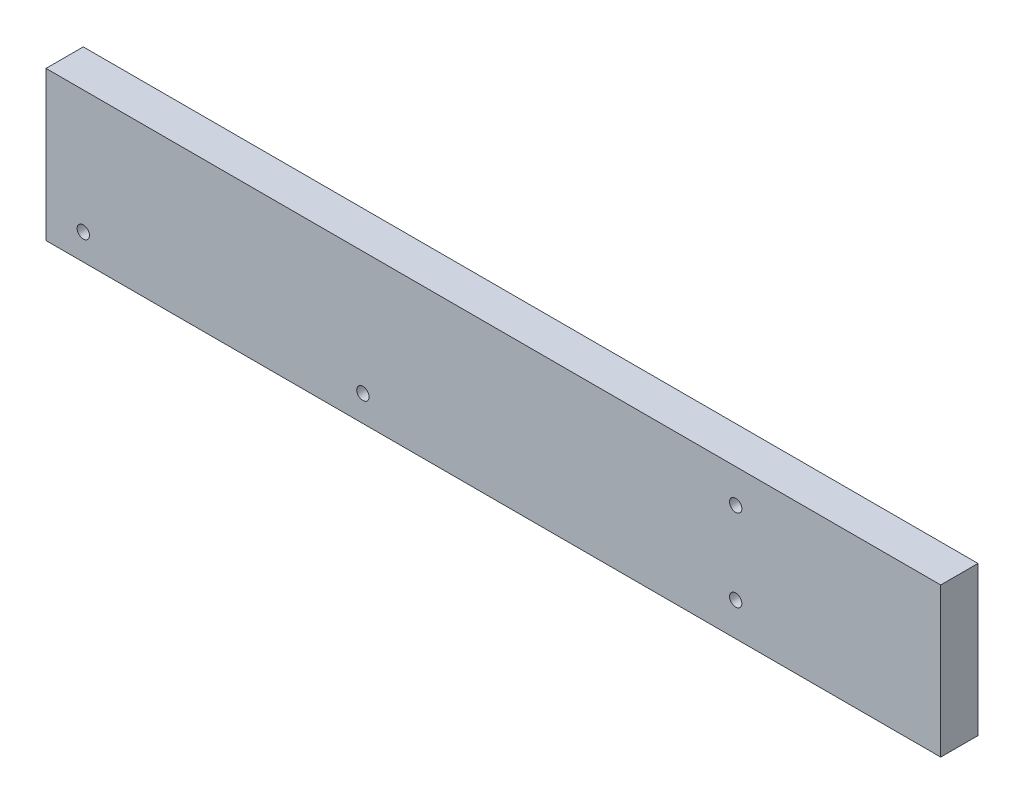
ISO-10303-21;
HEADER;
FILE_DESCRIPTION(('STEP AP214'),'2;1');
FILE_NAME('part.step','',(''),(''),'','','');
FILE_SCHEMA(('AUTOMOTIVE_DESIGN { 1 0 10303 214 1 1 1 1 }'));
ENDSEC;
DATA;
#1=APPLICATION_CONTEXT('core data for automotive mechanical design processes');
#2=APPLICATION_PROTOCOL_DEFINITION('international standard','automotive_design',2000,#1);
#3=PRODUCT_CONTEXT('',#1,'mechanical');
#4=PRODUCT('Part','Part','',(#3));
#5=PRODUCT_RELATED_PRODUCT_CATEGORY('part','',(#4));
#6=PRODUCT_DEFINITION_FORMATION('','',#4);
#7=PRODUCT_DEFINITION_CONTEXT('part definition',#1,'design');
#8=PRODUCT_DEFINITION('design','',#6,#7);
#9=PRODUCT_DEFINITION_SHAPE('','',#8);
#10=(LENGTH_UNIT() NAMED_UNIT(*) SI_UNIT(.MILLI.,.METRE.));
#11=(NAMED_UNIT(*) PLANE_ANGLE_UNIT() SI_UNIT($,.RADIAN.));
#12=(NAMED_UNIT(*) SI_UNIT($,.STERADIAN.) SOLID_ANGLE_UNIT());
#13=UNCERTAINTY_MEASURE_WITH_UNIT(LENGTH_MEASURE(1.E-05),#10,'distance_accuracy_value','');
#14=(GEOMETRIC_REPRESENTATION_CONTEXT(3) GLOBAL_UNCERTAINTY_ASSIGNED_CONTEXT((#13)) GLOBAL_UNIT_ASSIGNED_CONTEXT((#10,
#11,#12)) REPRESENTATION_CONTEXT('',''));
#15=CARTESIAN_POINT('',(0.,0.,0.));
#16=DIRECTION('',(0.,0.,1.));
#17=DIRECTION('',(1.,0.,0.));
#18=AXIS2_PLACEMENT_3D('',#15,#16,#17);
#19=CARTESIAN_POINT('',(-47.5,20.,5.));
#20=DIRECTION('',(1.,0.,0.));
#21=DIRECTION('',(0.,1.,0.));
#22=AXIS2_PLACEMENT_3D('',#19,#20,#21);
#23=PLANE('',#22);
#24=DIRECTION('',(0.,-1.,0.));
#25=VECTOR('',#24,1.);
#26=CARTESIAN_POINT('',(-47.5,20.,-5.));
#27=LINE('',#26,#25);
#28=CARTESIAN_POINT('',(-47.5,20.,-5.));
#29=VERTEX_POINT('',#28);
#30=CARTESIAN_POINT('',(-47.5,-20.,-5.));
#31=VERTEX_POINT('',#30);
#32=EDGE_CURVE('E106',#29,#31,#27,.T.);
#33=ORIENTED_EDGE('',*,*,#32,.T.);
#34=DIRECTION('',(0.,0.,-1.));
#35=VECTOR('',#34,1.);
#36=CARTESIAN_POINT('',(-47.5,-20.,5.));
#37=LINE('',#36,#35);
#38=CARTESIAN_POINT('',(-47.5,-20.,5.));
#39=VERTEX_POINT('',#38);
#40=EDGE_CURVE('E11',#39,#31,#37,.T.);
#41=ORIENTED_EDGE('',*,*,#40,.F.);
#42=DIRECTION('',(0.,-1.,0.));
#43=VECTOR('',#42,1.);
#44=CARTESIAN_POINT('',(-47.5,20.,5.));
#45=LINE('',#44,#43);
#46=CARTESIAN_POINT('',(-47.5,20.,5.));
#47=VERTEX_POINT('',#46);
#48=EDGE_CURVE('E88',#47,#39,#45,.T.);
#49=ORIENTED_EDGE('',*,*,#48,.F.);
#50=DIRECTION('',(0.,0.,-1.));
#51=VECTOR('',#50,1.);
#52=CARTESIAN_POINT('',(-47.5,20.,5.));
#53=LINE('',#52,#51);
#54=EDGE_CURVE('E102',#47,#29,#53,.T.);
#55=ORIENTED_EDGE('',*,*,#54,.T.);
#56=EDGE_LOOP('',(#33,#41,#49,#55));
#57=FACE_BOUND('',#56,.T.);
#58=ADVANCED_FACE('F36',(#57),#23,.F.);
#59=CARTESIAN_POINT('',(-47.5,-20.,5.));
#60=DIRECTION('',(0.,1.,0.));
#61=DIRECTION('',(-1.,0.,0.));
#62=AXIS2_PLACEMENT_3D('',#59,#60,#61);
#63=PLANE('',#62);
#64=DIRECTION('',(1.,0.,0.));
#65=VECTOR('',#64,1.);
#66=CARTESIAN_POINT('',(-47.5,-20.,-5.));
#67=LINE('',#66,#65);
#68=CARTESIAN_POINT('',(192.5,-20.,-5.));
#69=VERTEX_POINT('',#68);
#70=EDGE_CURVE('E93',#31,#69,#67,.T.);
#71=ORIENTED_EDGE('',*,*,#70,.T.);
#72=DIRECTION('',(0.,0.,-1.));
#73=VECTOR('',#72,1.);
#74=CARTESIAN_POINT('',(192.5,-20.,5.));
#75=LINE('',#74,#73);
#76=CARTESIAN_POINT('',(192.5,-20.,5.));
#77=VERTEX_POINT('',#76);
#78=EDGE_CURVE('E45',#77,#69,#75,.T.);
#79=ORIENTED_EDGE('',*,*,#78,.F.);
#80=DIRECTION('',(1.,0.,0.));
#81=VECTOR('',#80,1.);
#82=CARTESIAN_POINT('',(-47.5,-20.,5.));
#83=LINE('',#82,#81);
#84=EDGE_CURVE('E83',#39,#77,#83,.T.);
#85=ORIENTED_EDGE('',*,*,#84,.F.);
#86=ORIENTED_EDGE('',*,*,#40,.T.);
#87=EDGE_LOOP('',(#71,#79,#85,#86));
#88=FACE_BOUND('',#87,.T.);
#89=ADVANCED_FACE('F92',(#88),#63,.F.);
#90=CARTESIAN_POINT('',(192.5,20.,5.));
#91=DIRECTION('',(-1.,0.,0.));
#92=DIRECTION('',(0.,0.,1.));
#93=AXIS2_PLACEMENT_3D('',#90,#91,#92);
#94=PLANE('',#93);
#95=DIRECTION('',(0.,1.,0.));
#96=VECTOR('',#95,1.);
#97=CARTESIAN_POINT('',(192.5,20.,-5.));
#98=LINE('',#97,#96);
#99=CARTESIAN_POINT('',(192.5,20.,-5.));
#100=VERTEX_POINT('',#99);
#101=EDGE_CURVE('E70',#69,#100,#98,.T.);
#102=ORIENTED_EDGE('',*,*,#101,.T.);
#103=DIRECTION('',(0.,0.,-1.));
#104=VECTOR('',#103,1.);
#105=CARTESIAN_POINT('',(192.5,20.,5.));
#106=LINE('',#105,#104);
#107=CARTESIAN_POINT('',(192.5,20.,5.));
#108=VERTEX_POINT('',#107);
#109=EDGE_CURVE('E95',#108,#100,#106,.T.);
#110=ORIENTED_EDGE('',*,*,#109,.F.);
#111=DIRECTION('',(0.,1.,0.));
#112=VECTOR('',#111,1.);
#113=CARTESIAN_POINT('',(192.5,20.,5.));
#114=LINE('',#113,#112);
#115=EDGE_CURVE('E86',#77,#108,#114,.T.);
#116=ORIENTED_EDGE('',*,*,#115,.F.);
#117=ORIENTED_EDGE('',*,*,#78,.T.);
#118=EDGE_LOOP('',(#102,#110,#116,#117));
#119=FACE_BOUND('',#118,.T.);
#120=ADVANCED_FACE('F96',(#119),#94,.F.);
#121=CARTESIAN_POINT('',(-47.5,20.,5.));
#122=DIRECTION('',(0.,-1.,0.));
#123=DIRECTION('',(0.,0.,-1.));
#124=AXIS2_PLACEMENT_3D('',#121,#122,#123);
#125=PLANE('',#124);
#126=DIRECTION('',(-1.,0.,0.));
#127=VECTOR('',#126,1.);
#128=CARTESIAN_POINT('',(-47.5,20.,-5.));
#129=LINE('',#128,#127);
#130=EDGE_CURVE('E76',#100,#29,#129,.T.);
#131=ORIENTED_EDGE('',*,*,#130,.T.);
#132=ORIENTED_EDGE('',*,*,#54,.F.);
#133=DIRECTION('',(-1.,0.,0.));
#134=VECTOR('',#133,1.);
#135=CARTESIAN_POINT('',(-47.5,20.,5.));
#136=LINE('',#135,#134);
#137=EDGE_CURVE('E53',#108,#47,#136,.T.);
#138=ORIENTED_EDGE('',*,*,#137,.F.);
#139=ORIENTED_EDGE('',*,*,#109,.T.);
#140=EDGE_LOOP('',(#131,#132,#138,#139));
#141=FACE_BOUND('',#140,.T.);
#142=ADVANCED_FACE('F120',(#141),#125,.F.);
#143=CARTESIAN_POINT('',(-47.5,20.,5.));
#144=DIRECTION('',(0.,0.,1.));
#145=DIRECTION('',(1.,0.,0.));
#146=AXIS2_PLACEMENT_3D('',#143,#144,#145);
#147=PLANE('',#146);
#148=CARTESIAN_POINT('',(-37.5,-13.,5.));
#149=DIRECTION('',(0.,0.,1.));
#150=DIRECTION('',(1.,0.,0.));
#151=AXIS2_PLACEMENT_3D('',#148,#149,#150);
#152=CIRCLE('',#151,1.65);
#153=CARTESIAN_POINT('',(-35.85,-13.,5.));
#154=VERTEX_POINT('',#153);
#155=EDGE_CURVE('E149',#154,#154,#152,.T.);
#156=ORIENTED_EDGE('',*,*,#155,.F.);
#157=EDGE_LOOP('',(#156));
#158=FACE_BOUND('',#157,.T.);
#159=CARTESIAN_POINT('',(37.5,-13.,5.));
#160=DIRECTION('',(0.,0.,1.));
#161=DIRECTION('',(1.,0.,0.));
#162=AXIS2_PLACEMENT_3D('',#159,#160,#161);
#163=CIRCLE('',#162,1.65);
#164=CARTESIAN_POINT('',(39.15,-13.,5.));
#165=VERTEX_POINT('',#164);
#166=EDGE_CURVE('E142',#165,#165,#163,.T.);
#167=ORIENTED_EDGE('',*,*,#166,.F.);
#168=EDGE_LOOP('',(#167));
#169=FACE_BOUND('',#168,.T.);
#170=CARTESIAN_POINT('',(137.5,-11.,5.));
#171=DIRECTION('',(0.,0.,1.));
#172=DIRECTION('',(1.,0.,0.));
#173=AXIS2_PLACEMENT_3D('',#170,#171,#172);
#174=CIRCLE('',#173,1.64999999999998);
#175=CARTESIAN_POINT('',(139.15,-11.,5.));
#176=VERTEX_POINT('',#175);
#177=EDGE_CURVE('E134',#176,#176,#174,.T.);
#178=ORIENTED_EDGE('',*,*,#177,.F.);
#179=EDGE_LOOP('',(#178));
#180=FACE_BOUND('',#179,.T.);
#181=CARTESIAN_POINT('',(137.5,11.,5.));
#182=DIRECTION('',(0.,0.,1.));
#183=DIRECTION('',(1.,0.,0.));
#184=AXIS2_PLACEMENT_3D('',#181,#182,#183);
#185=CIRCLE('',#184,1.64999999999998);
#186=CARTESIAN_POINT('',(139.15,11.,5.));
#187=VERTEX_POINT('',#186);
#188=EDGE_CURVE('E110',#187,#187,#185,.T.);
#189=ORIENTED_EDGE('',*,*,#188,.F.);
#190=EDGE_LOOP('',(#189));
#191=FACE_BOUND('',#190,.T.);
#192=ORIENTED_EDGE('',*,*,#48,.T.);
#193=ORIENTED_EDGE('',*,*,#84,.T.);
#194=ORIENTED_EDGE('',*,*,#115,.T.);
#195=ORIENTED_EDGE('',*,*,#137,.T.);
#196=EDGE_LOOP('',(#192,#193,#194,#195));
#197=FACE_BOUND('',#196,.T.);
#198=ADVANCED_FACE('F84',(#158,#169,#180,#191,#197),#147,.T.);
#199=CARTESIAN_POINT('',(-47.5,20.,-5.));
#200=DIRECTION('',(0.,0.,1.));
#201=DIRECTION('',(1.,0.,0.));
#202=AXIS2_PLACEMENT_3D('',#199,#200,#201);
#203=PLANE('',#202);
#204=CARTESIAN_POINT('',(-37.5,-13.,-5.));
#205=DIRECTION('',(0.,0.,1.));
#206=DIRECTION('',(1.,0.,0.));
#207=AXIS2_PLACEMENT_3D('',#204,#205,#206);
#208=CIRCLE('',#207,1.65);
#209=CARTESIAN_POINT('',(-35.85,-13.,-5.));
#210=VERTEX_POINT('',#209);
#211=EDGE_CURVE('E153',#210,#210,#208,.T.);
#212=ORIENTED_EDGE('',*,*,#211,.T.);
#213=EDGE_LOOP('',(#212));
#214=FACE_BOUND('',#213,.T.);
#215=CARTESIAN_POINT('',(37.5,-13.,-5.));
#216=DIRECTION('',(0.,0.,1.));
#217=DIRECTION('',(1.,0.,0.));
#218=AXIS2_PLACEMENT_3D('',#215,#216,#217);
#219=CIRCLE('',#218,1.65);
#220=CARTESIAN_POINT('',(39.15,-13.,-5.));
#221=VERTEX_POINT('',#220);
#222=EDGE_CURVE('E145',#221,#221,#219,.T.);
#223=ORIENTED_EDGE('',*,*,#222,.T.);
#224=EDGE_LOOP('',(#223));
#225=FACE_BOUND('',#224,.T.);
#226=CARTESIAN_POINT('',(137.5,-11.,-5.));
#227=DIRECTION('',(0.,0.,1.));
#228=DIRECTION('',(1.,0.,0.));
#229=AXIS2_PLACEMENT_3D('',#226,#227,#228);
#230=CIRCLE('',#229,1.64999999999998);
#231=CARTESIAN_POINT('',(139.15,-11.,-5.));
#232=VERTEX_POINT('',#231);
#233=EDGE_CURVE('E138',#232,#232,#230,.T.);
#234=ORIENTED_EDGE('',*,*,#233,.T.);
#235=EDGE_LOOP('',(#234));
#236=FACE_BOUND('',#235,.T.);
#237=CARTESIAN_POINT('',(137.5,11.,-5.));
#238=DIRECTION('',(0.,0.,1.));
#239=DIRECTION('',(1.,0.,0.));
#240=AXIS2_PLACEMENT_3D('',#237,#238,#239);
#241=CIRCLE('',#240,1.64999999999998);
#242=CARTESIAN_POINT('',(139.15,11.,-5.));
#243=VERTEX_POINT('',#242);
#244=EDGE_CURVE('E130',#243,#243,#241,.T.);
#245=ORIENTED_EDGE('',*,*,#244,.T.);
#246=EDGE_LOOP('',(#245));
#247=FACE_BOUND('',#246,.T.);
#248=ORIENTED_EDGE('',*,*,#32,.F.);
#249=ORIENTED_EDGE('',*,*,#130,.F.);
#250=ORIENTED_EDGE('',*,*,#101,.F.);
#251=ORIENTED_EDGE('',*,*,#70,.F.);
#252=EDGE_LOOP('',(#248,#249,#250,#251));
#253=FACE_BOUND('',#252,.T.);
#254=ADVANCED_FACE('F123',(#214,#225,#236,#247,#253),#203,.F.);
#255=CARTESIAN_POINT('',(137.5,11.,5.));
#256=DIRECTION('',(0.,0.,1.));
#257=DIRECTION('',(1.,0.,0.));
#258=AXIS2_PLACEMENT_3D('',#255,#256,#257);
#259=CYLINDRICAL_SURFACE('',#258,1.64999999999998);
#260=ORIENTED_EDGE('',*,*,#244,.F.);
#261=EDGE_LOOP('',(#260));
#262=FACE_BOUND('',#261,.T.);
#263=ORIENTED_EDGE('',*,*,#188,.T.);
#264=EDGE_LOOP('',(#263));
#265=FACE_BOUND('',#264,.T.);
#266=ADVANCED_FACE('F175',(#262,#265),#259,.F.);
#267=CARTESIAN_POINT('',(137.5,-11.,5.));
#268=DIRECTION('',(0.,0.,1.));
#269=DIRECTION('',(1.,0.,0.));
#270=AXIS2_PLACEMENT_3D('',#267,#268,#269);
#271=CYLINDRICAL_SURFACE('',#270,1.64999999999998);
#272=ORIENTED_EDGE('',*,*,#233,.F.);
#273=EDGE_LOOP('',(#272));
#274=FACE_BOUND('',#273,.T.);
#275=ORIENTED_EDGE('',*,*,#177,.T.);
#276=EDGE_LOOP('',(#275));
#277=FACE_BOUND('',#276,.T.);
#278=ADVANCED_FACE('F177',(#274,#277),#271,.F.);
#279=CARTESIAN_POINT('',(37.5,-13.,5.));
#280=DIRECTION('',(0.,0.,1.));
#281=DIRECTION('',(1.,0.,0.));
#282=AXIS2_PLACEMENT_3D('',#279,#280,#281);
#283=CYLINDRICAL_SURFACE('',#282,1.65);
#284=ORIENTED_EDGE('',*,*,#222,.F.);
#285=EDGE_LOOP('',(#284));
#286=FACE_BOUND('',#285,.T.);
#287=ORIENTED_EDGE('',*,*,#166,.T.);
#288=EDGE_LOOP('',(#287));
#289=FACE_BOUND('',#288,.T.);
#290=ADVANCED_FACE('F162',(#286,#289),#283,.F.);
#291=CARTESIAN_POINT('',(-37.5,-13.,5.));
#292=DIRECTION('',(0.,0.,1.));
#293=DIRECTION('',(1.,0.,0.));
#294=AXIS2_PLACEMENT_3D('',#291,#292,#293);
#295=CYLINDRICAL_SURFACE('',#294,1.65);
#296=ORIENTED_EDGE('',*,*,#211,.F.);
#297=EDGE_LOOP('',(#296));
#298=FACE_BOUND('',#297,.T.);
#299=ORIENTED_EDGE('',*,*,#155,.T.);
#300=EDGE_LOOP('',(#299));
#301=FACE_BOUND('',#300,.T.);
#302=ADVANCED_FACE('F159',(#298,#301),#295,.F.);
#303=CLOSED_SHELL('',(#58,#89,#120,#142,#198,#254,#266,#278,#290,#302));
#304=MANIFOLD_SOLID_BREP('B2',#303);
#305=ADVANCED_BREP_SHAPE_REPRESENTATION('',(#18,#304),#14);
#306=SHAPE_DEFINITION_REPRESENTATION(#9,#305);
ENDSEC;
END-ISO-10303-21;
